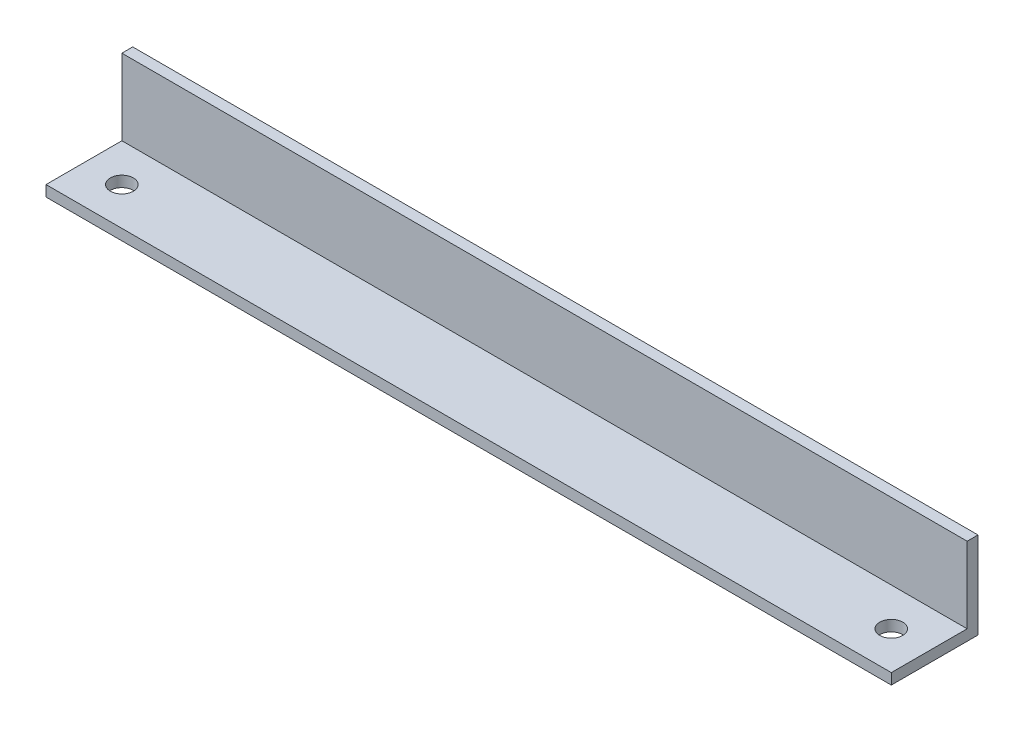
from build123d import *

# Parameters (mm, degrees)
SKETCH1_W           = 247.65
SKETCH1_H           = 25.4
BOSS_EXTRUDE1_DEPTH = 3.175
SKETCH2_W           = 247.65
SKETCH2_H           = 3.175
BOSS_EXTRUDE2_DEPTH = 22.225
SKETCH3_R           = 3.3782
CUT_EXTRUDE1_DEPTH  = 127.443154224


with BuildPart() as part:
    # Sketch1 → Boss-Extrude1 (new body)
    with BuildSketch(Plane(origin=(0, 0, 0), x_dir=(1, 0, 0), z_dir=(0, 1, 0))):
        Rectangle(SKETCH1_W, SKETCH1_H)
    extrude(amount=BOSS_EXTRUDE1_DEPTH)

    # Sketch2 → Boss-Extrude2 (add)
    with BuildSketch(Plane(origin=(0, 3.175, 0), x_dir=(1, 0, 0), z_dir=(0, 1, 0))):
        with Locations((0, 11.1125)):
            Rectangle(SKETCH2_W, SKETCH2_H)
    extrude(amount=BOSS_EXTRUDE2_DEPTH)

    # Sketch3 → Cut-Extrude1 (cut, through all)
    with BuildSketch(Plane(origin=(0, 3.175, 0), x_dir=(1, 0, 0), z_dir=(0, 1, 0))):
        with Locations(Location((-112.7125, -1.5875, 0), (0, 0, 270))):
            Circle(SKETCH3_R)
        with Locations(Location((112.7125, -1.5875, 0), (0, 0, 270))):
            Circle(SKETCH3_R)
    extrude(amount=-CUT_EXTRUDE1_DEPTH, mode=Mode.SUBTRACT)


solid = part.part
